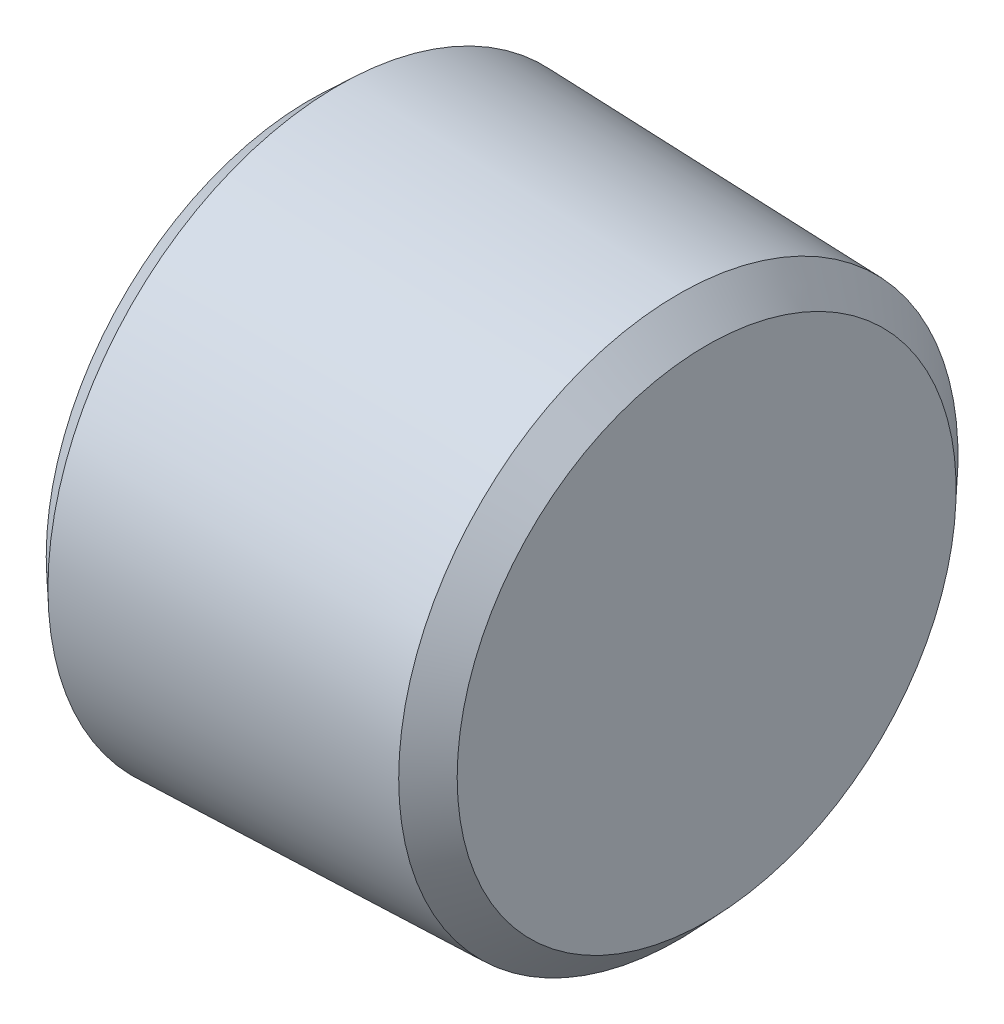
ISO-10303-21;
HEADER;
FILE_DESCRIPTION(('STEP AP214'),'2;1');
FILE_NAME('part.step','',(''),(''),'','','');
FILE_SCHEMA(('AUTOMOTIVE_DESIGN { 1 0 10303 214 1 1 1 1 }'));
ENDSEC;
DATA;
#1=APPLICATION_CONTEXT('core data for automotive mechanical design processes');
#2=APPLICATION_PROTOCOL_DEFINITION('international standard','automotive_design',2000,#1);
#3=PRODUCT_CONTEXT('',#1,'mechanical');
#4=PRODUCT('Part','Part','',(#3));
#5=PRODUCT_RELATED_PRODUCT_CATEGORY('part','',(#4));
#6=PRODUCT_DEFINITION_FORMATION('','',#4);
#7=PRODUCT_DEFINITION_CONTEXT('part definition',#1,'design');
#8=PRODUCT_DEFINITION('design','',#6,#7);
#9=PRODUCT_DEFINITION_SHAPE('','',#8);
#10=(LENGTH_UNIT() NAMED_UNIT(*) SI_UNIT(.MILLI.,.METRE.));
#11=(NAMED_UNIT(*) PLANE_ANGLE_UNIT() SI_UNIT($,.RADIAN.));
#12=(NAMED_UNIT(*) SI_UNIT($,.STERADIAN.) SOLID_ANGLE_UNIT());
#13=UNCERTAINTY_MEASURE_WITH_UNIT(LENGTH_MEASURE(1.E-05),#10,'distance_accuracy_value','');
#14=(GEOMETRIC_REPRESENTATION_CONTEXT(3) GLOBAL_UNCERTAINTY_ASSIGNED_CONTEXT((#13)) GLOBAL_UNIT_ASSIGNED_CONTEXT((#10,
#11,#12)) REPRESENTATION_CONTEXT('',''));
#15=CARTESIAN_POINT('',(0.,0.,0.));
#16=DIRECTION('',(0.,0.,1.));
#17=DIRECTION('',(1.,0.,0.));
#18=AXIS2_PLACEMENT_3D('',#15,#16,#17);
#19=CARTESIAN_POINT('',(3.50000000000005,1.44337567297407,-2.49999999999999));
#20=DIRECTION('',(-1.,0.,0.));
#21=DIRECTION('',(0.,0.,1.));
#22=AXIS2_PLACEMENT_3D('',#19,#20,#21);
#23=PLANE('',#22);
#24=CARTESIAN_POINT('',(3.5,0.,0.));
#25=DIRECTION('',(-1.,0.,0.));
#26=DIRECTION('',(0.,0.,1.));
#27=AXIS2_PLACEMENT_3D('',#24,#25,#26);
#28=CIRCLE('',#27,2.5);
#29=CARTESIAN_POINT('',(3.49999999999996,0.,2.50000000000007));
#30=VERTEX_POINT('',#29);
#31=CARTESIAN_POINT('',(3.5,2.1650635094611,1.25000000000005));
#32=VERTEX_POINT('',#31);
#33=EDGE_CURVE('E41',#30,#32,#28,.T.);
#34=ORIENTED_EDGE('',*,*,#33,.F.);
#35=DIRECTION('',(0.,-1.,0.));
#36=VECTOR('',#35,1.);
#37=CARTESIAN_POINT('',(3.5,1.44337567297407,2.50000000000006));
#38=LINE('',#37,#36);
#39=CARTESIAN_POINT('',(3.5,1.44337567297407,2.50000000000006));
#40=VERTEX_POINT('',#39);
#41=EDGE_CURVE('E129',#40,#30,#38,.T.);
#42=ORIENTED_EDGE('',*,*,#41,.F.);
#43=DIRECTION('',(0.,-0.5,0.866025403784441));
#44=VECTOR('',#43,1.);
#45=CARTESIAN_POINT('',(3.50000000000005,2.88675134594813,0.));
#46=LINE('',#45,#44);
#47=EDGE_CURVE('E127',#32,#40,#46,.T.);
#48=ORIENTED_EDGE('',*,*,#47,.F.);
#49=EDGE_LOOP('',(#34,#42,#48));
#50=FACE_BOUND('',#49,.T.);
#51=ADVANCED_FACE('F30',(#50),#23,.T.);
#52=CARTESIAN_POINT('',(3.50000000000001,2.1650635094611,-1.25));
#53=VERTEX_POINT('',#52);
#54=EDGE_CURVE('E11',#32,#53,#28,.T.);
#55=ORIENTED_EDGE('',*,*,#54,.F.);
#56=CARTESIAN_POINT('',(3.50000000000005,2.88675134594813,0.));
#57=VERTEX_POINT('',#56);
#58=EDGE_CURVE('E123',#57,#32,#46,.T.);
#59=ORIENTED_EDGE('',*,*,#58,.F.);
#60=DIRECTION('',(0.,0.5,0.86602540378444));
#61=VECTOR('',#60,1.);
#62=CARTESIAN_POINT('',(3.50000000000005,1.44337567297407,-2.49999999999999));
#63=LINE('',#62,#61);
#64=EDGE_CURVE('E125',#53,#57,#63,.T.);
#65=ORIENTED_EDGE('',*,*,#64,.F.);
#66=EDGE_LOOP('',(#55,#59,#65));
#67=FACE_BOUND('',#66,.T.);
#68=ADVANCED_FACE('F121',(#67),#23,.T.);
#69=CARTESIAN_POINT('',(3.50000000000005,0.,-2.5));
#70=VERTEX_POINT('',#69);
#71=EDGE_CURVE('E39',#53,#70,#28,.T.);
#72=ORIENTED_EDGE('',*,*,#71,.F.);
#73=CARTESIAN_POINT('',(3.50000000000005,1.44337567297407,-2.49999999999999));
#74=VERTEX_POINT('',#73);
#75=EDGE_CURVE('E132',#74,#53,#63,.T.);
#76=ORIENTED_EDGE('',*,*,#75,.F.);
#77=DIRECTION('',(0.,1.,0.));
#78=VECTOR('',#77,1.);
#79=CARTESIAN_POINT('',(3.50000000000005,-1.44337567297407,-2.49999999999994));
#80=LINE('',#79,#78);
#81=EDGE_CURVE('E149',#70,#74,#80,.T.);
#82=ORIENTED_EDGE('',*,*,#81,.F.);
#83=EDGE_LOOP('',(#72,#76,#82));
#84=FACE_BOUND('',#83,.T.);
#85=ADVANCED_FACE('F198',(#84),#23,.T.);
#86=CARTESIAN_POINT('',(3.5,-2.1650635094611,-1.24999999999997));
#87=VERTEX_POINT('',#86);
#88=EDGE_CURVE('E176',#70,#87,#28,.T.);
#89=ORIENTED_EDGE('',*,*,#88,.F.);
#90=CARTESIAN_POINT('',(3.50000000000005,-1.44337567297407,-2.49999999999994));
#91=VERTEX_POINT('',#90);
#92=EDGE_CURVE('E150',#91,#70,#80,.T.);
#93=ORIENTED_EDGE('',*,*,#92,.F.);
#94=DIRECTION('',(0.,0.5,-0.866025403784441));
#95=VECTOR('',#94,1.);
#96=CARTESIAN_POINT('',(3.5,-2.88675134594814,1.04083408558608E-13));
#97=LINE('',#96,#95);
#98=EDGE_CURVE('E145',#87,#91,#97,.T.);
#99=ORIENTED_EDGE('',*,*,#98,.F.);
#100=EDGE_LOOP('',(#89,#93,#99));
#101=FACE_BOUND('',#100,.T.);
#102=ADVANCED_FACE('F207',(#101),#23,.T.);
#103=CARTESIAN_POINT('',(3.5,-2.1650635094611,1.25000000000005));
#104=VERTEX_POINT('',#103);
#105=EDGE_CURVE('E48',#87,#104,#28,.T.);
#106=ORIENTED_EDGE('',*,*,#105,.F.);
#107=CARTESIAN_POINT('',(3.5,-2.88675134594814,1.04083408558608E-13));
#108=VERTEX_POINT('',#107);
#109=EDGE_CURVE('E146',#108,#87,#97,.T.);
#110=ORIENTED_EDGE('',*,*,#109,.F.);
#111=DIRECTION('',(0.,-0.5,-0.86602540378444));
#112=VECTOR('',#111,1.);
#113=CARTESIAN_POINT('',(3.49999999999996,-1.44337567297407,2.50000000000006));
#114=LINE('',#113,#112);
#115=EDGE_CURVE('E141',#104,#108,#114,.T.);
#116=ORIENTED_EDGE('',*,*,#115,.F.);
#117=EDGE_LOOP('',(#106,#110,#116));
#118=FACE_BOUND('',#117,.T.);
#119=ADVANCED_FACE('F206',(#118),#23,.T.);
#120=CARTESIAN_POINT('',(0.,0.,0.));
#121=DIRECTION('',(1.,0.,0.));
#122=DIRECTION('',(0.,0.,-1.));
#123=AXIS2_PLACEMENT_3D('',#120,#121,#122);
#124=PLANE('',#123);
#125=CARTESIAN_POINT('',(0.,0.,0.));
#126=DIRECTION('',(-1.,0.,0.));
#127=DIRECTION('',(0.,0.,1.));
#128=AXIS2_PLACEMENT_3D('',#125,#126,#127);
#129=CIRCLE('',#128,4.65153175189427);
#130=CARTESIAN_POINT('',(0.,0.,4.65153175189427));
#131=VERTEX_POINT('',#130);
#132=EDGE_CURVE('E34',#131,#131,#129,.T.);
#133=ORIENTED_EDGE('',*,*,#132,.T.);
#134=EDGE_LOOP('',(#133));
#135=FACE_BOUND('',#134,.T.);
#136=DIRECTION('',(0.,0.5,0.86602540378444));
#137=VECTOR('',#136,1.);
#138=CARTESIAN_POINT('',(0.,1.44337567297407,-2.49999999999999));
#139=LINE('',#138,#137);
#140=CARTESIAN_POINT('',(0.,1.44337567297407,-2.49999999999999));
#141=VERTEX_POINT('',#140);
#142=CARTESIAN_POINT('',(0.,2.88675134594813,0.));
#143=VERTEX_POINT('',#142);
#144=EDGE_CURVE('E56',#141,#143,#139,.T.);
#145=ORIENTED_EDGE('',*,*,#144,.T.);
#146=DIRECTION('',(0.,-0.5,0.866025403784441));
#147=VECTOR('',#146,1.);
#148=CARTESIAN_POINT('',(0.,2.88675134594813,0.));
#149=LINE('',#148,#147);
#150=CARTESIAN_POINT('',(0.,1.44337567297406,2.5000000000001));
#151=VERTEX_POINT('',#150);
#152=EDGE_CURVE('E179',#143,#151,#149,.T.);
#153=ORIENTED_EDGE('',*,*,#152,.T.);
#154=DIRECTION('',(0.,-1.,0.));
#155=VECTOR('',#154,1.);
#156=CARTESIAN_POINT('',(0.,1.44337567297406,2.5000000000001));
#157=LINE('',#156,#155);
#158=CARTESIAN_POINT('',(0.,-1.44337567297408,2.50000000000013));
#159=VERTEX_POINT('',#158);
#160=EDGE_CURVE('E182',#151,#159,#157,.T.);
#161=ORIENTED_EDGE('',*,*,#160,.T.);
#162=DIRECTION('',(0.,-0.5,-0.86602540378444));
#163=VECTOR('',#162,1.);
#164=CARTESIAN_POINT('',(0.,-1.44337567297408,2.50000000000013));
#165=LINE('',#164,#163);
#166=CARTESIAN_POINT('',(0.,-2.88675134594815,1.04083408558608E-13));
#167=VERTEX_POINT('',#166);
#168=EDGE_CURVE('E185',#159,#167,#165,.T.);
#169=ORIENTED_EDGE('',*,*,#168,.T.);
#170=DIRECTION('',(0.,0.5,-0.866025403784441));
#171=VECTOR('',#170,1.);
#172=CARTESIAN_POINT('',(0.,-2.88675134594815,1.04083408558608E-13));
#173=LINE('',#172,#171);
#174=CARTESIAN_POINT('',(0.,-1.44337567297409,-2.49999999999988));
#175=VERTEX_POINT('',#174);
#176=EDGE_CURVE('E188',#167,#175,#173,.T.);
#177=ORIENTED_EDGE('',*,*,#176,.T.);
#178=DIRECTION('',(0.,1.,0.));
#179=VECTOR('',#178,1.);
#180=CARTESIAN_POINT('',(0.,-1.44337567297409,-2.49999999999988));
#181=LINE('',#180,#179);
#182=EDGE_CURVE('E190',#175,#141,#181,.T.);
#183=ORIENTED_EDGE('',*,*,#182,.T.);
#184=EDGE_LOOP('',(#145,#153,#161,#169,#177,#183));
#185=FACE_BOUND('',#184,.T.);
#186=ADVANCED_FACE('F32',(#135,#185),#124,.F.);
#187=CARTESIAN_POINT('',(0.499756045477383,0.,0.));
#188=DIRECTION('',(1.,0.,0.));
#189=DIRECTION('',(0.,0.,-1.));
#190=AXIS2_PLACEMENT_3D('',#187,#188,#189);
#191=CONICAL_SURFACE('',#190,5.121,0.754158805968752);
#192=ORIENTED_EDGE('',*,*,#132,.F.);
#193=EDGE_LOOP('',(#192));
#194=FACE_BOUND('',#193,.T.);
#195=CARTESIAN_POINT('',(0.499756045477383,0.,0.));
#196=DIRECTION('',(-1.,0.,0.));
#197=DIRECTION('',(0.,0.,1.));
#198=AXIS2_PLACEMENT_3D('',#195,#196,#197);
#199=CIRCLE('',#198,5.121);
#200=CARTESIAN_POINT('',(0.499756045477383,0.,5.121));
#201=VERTEX_POINT('',#200);
#202=EDGE_CURVE('E169',#201,#201,#199,.T.);
#203=ORIENTED_EDGE('',*,*,#202,.T.);
#204=EDGE_LOOP('',(#203));
#205=FACE_BOUND('',#204,.T.);
#206=ADVANCED_FACE('F223',(#194,#205),#191,.T.);
#207=CARTESIAN_POINT('',(6.50024395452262,0.,0.));
#208=DIRECTION('',(-1.,0.,0.));
#209=DIRECTION('',(0.,0.,1.));
#210=AXIS2_PLACEMENT_3D('',#207,#208,#209);
#211=CONICAL_SURFACE('',#210,4.93348761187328,0.0312393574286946);
#212=ORIENTED_EDGE('',*,*,#202,.F.);
#213=EDGE_LOOP('',(#212));
#214=FACE_BOUND('',#213,.T.);
#215=CARTESIAN_POINT('',(6.50024395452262,0.,0.));
#216=DIRECTION('',(-1.,0.,0.));
#217=DIRECTION('',(0.,0.,1.));
#218=AXIS2_PLACEMENT_3D('',#215,#216,#217);
#219=CIRCLE('',#218,4.93348761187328);
#220=CARTESIAN_POINT('',(6.50024395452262,0.,4.93348761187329));
#221=VERTEX_POINT('',#220);
#222=EDGE_CURVE('E167',#221,#221,#219,.T.);
#223=ORIENTED_EDGE('',*,*,#222,.T.);
#224=EDGE_LOOP('',(#223));
#225=FACE_BOUND('',#224,.T.);
#226=ADVANCED_FACE('F228',(#214,#225),#211,.T.);
#227=CARTESIAN_POINT('',(7.,0.,0.));
#228=DIRECTION('',(-1.,0.,0.));
#229=DIRECTION('',(0.,0.,1.));
#230=AXIS2_PLACEMENT_3D('',#227,#228,#229);
#231=CONICAL_SURFACE('',#230,4.40148974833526,0.81663752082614);
#232=ORIENTED_EDGE('',*,*,#222,.F.);
#233=EDGE_LOOP('',(#232));
#234=FACE_BOUND('',#233,.T.);
#235=CARTESIAN_POINT('',(7.,0.,0.));
#236=DIRECTION('',(-1.,0.,0.));
#237=DIRECTION('',(0.,0.,1.));
#238=AXIS2_PLACEMENT_3D('',#235,#236,#237);
#239=CIRCLE('',#238,4.40148974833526);
#240=CARTESIAN_POINT('',(7.,0.,4.40148974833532));
#241=VERTEX_POINT('',#240);
#242=EDGE_CURVE('E164',#241,#241,#239,.T.);
#243=ORIENTED_EDGE('',*,*,#242,.T.);
#244=EDGE_LOOP('',(#243));
#245=FACE_BOUND('',#244,.T.);
#246=ADVANCED_FACE('F258',(#234,#245),#231,.T.);
#247=CARTESIAN_POINT('',(7.00000000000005,4.40148974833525,0.));
#248=DIRECTION('',(-1.,0.,0.));
#249=DIRECTION('',(0.,0.,1.));
#250=AXIS2_PLACEMENT_3D('',#247,#248,#249);
#251=PLANE('',#250);
#252=ORIENTED_EDGE('',*,*,#242,.F.);
#253=EDGE_LOOP('',(#252));
#254=FACE_BOUND('',#253,.T.);
#255=ADVANCED_FACE('F255',(#254),#251,.F.);
#256=CARTESIAN_POINT('',(3.50000000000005,1.44337567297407,-2.49999999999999));
#257=DIRECTION('',(0.,-0.866025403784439,0.500000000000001));
#258=DIRECTION('',(0.,-0.5,-0.86602540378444));
#259=AXIS2_PLACEMENT_3D('',#256,#257,#258);
#260=PLANE('',#259);
#261=ORIENTED_EDGE('',*,*,#144,.F.);
#262=DIRECTION('',(-1.,0.,0.));
#263=VECTOR('',#262,1.);
#264=CARTESIAN_POINT('',(3.50000000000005,1.44337567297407,-2.49999999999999));
#265=LINE('',#264,#263);
#266=EDGE_CURVE('E153',#74,#141,#265,.T.);
#267=ORIENTED_EDGE('',*,*,#266,.F.);
#268=ORIENTED_EDGE('',*,*,#75,.T.);
#269=ORIENTED_EDGE('',*,*,#64,.T.);
#270=DIRECTION('',(-1.,0.,0.));
#271=VECTOR('',#270,1.);
#272=CARTESIAN_POINT('',(3.50000000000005,2.88675134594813,0.));
#273=LINE('',#272,#271);
#274=EDGE_CURVE('E135',#57,#143,#273,.T.);
#275=ORIENTED_EDGE('',*,*,#274,.T.);
#276=EDGE_LOOP('',(#261,#267,#268,#269,#275));
#277=FACE_BOUND('',#276,.T.);
#278=ADVANCED_FACE('F195',(#277),#260,.T.);
#279=CARTESIAN_POINT('',(3.50000000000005,2.88675134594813,0.));
#280=DIRECTION('',(0.,-0.866025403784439,-0.5));
#281=DIRECTION('',(0.,0.5,-0.866025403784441));
#282=AXIS2_PLACEMENT_3D('',#279,#280,#281);
#283=PLANE('',#282);
#284=ORIENTED_EDGE('',*,*,#152,.F.);
#285=ORIENTED_EDGE('',*,*,#274,.F.);
#286=ORIENTED_EDGE('',*,*,#58,.T.);
#287=ORIENTED_EDGE('',*,*,#47,.T.);
#288=DIRECTION('',(-1.,0.,0.));
#289=VECTOR('',#288,1.);
#290=CARTESIAN_POINT('',(3.5,1.44337567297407,2.50000000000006));
#291=LINE('',#290,#289);
#292=EDGE_CURVE('E161',#40,#151,#291,.T.);
#293=ORIENTED_EDGE('',*,*,#292,.T.);
#294=EDGE_LOOP('',(#284,#285,#286,#287,#293));
#295=FACE_BOUND('',#294,.T.);
#296=ADVANCED_FACE('F134',(#295),#283,.T.);
#297=CARTESIAN_POINT('',(3.5,1.44337567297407,2.50000000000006));
#298=DIRECTION('',(0.,0.,-1.));
#299=DIRECTION('',(-1.,0.,0.));
#300=AXIS2_PLACEMENT_3D('',#297,#298,#299);
#301=PLANE('',#300);
#302=ORIENTED_EDGE('',*,*,#160,.F.);
#303=ORIENTED_EDGE('',*,*,#292,.F.);
#304=ORIENTED_EDGE('',*,*,#41,.T.);
#305=CARTESIAN_POINT('',(3.49999999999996,-1.44337567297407,2.50000000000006));
#306=VERTEX_POINT('',#305);
#307=EDGE_CURVE('E136',#30,#306,#38,.T.);
#308=ORIENTED_EDGE('',*,*,#307,.T.);
#309=DIRECTION('',(-1.,0.,0.));
#310=VECTOR('',#309,1.);
#311=CARTESIAN_POINT('',(3.49999999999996,-1.44337567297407,2.50000000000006));
#312=LINE('',#311,#310);
#313=EDGE_CURVE('E159',#306,#159,#312,.T.);
#314=ORIENTED_EDGE('',*,*,#313,.T.);
#315=EDGE_LOOP('',(#302,#303,#304,#308,#314));
#316=FACE_BOUND('',#315,.T.);
#317=ADVANCED_FACE('F221',(#316),#301,.T.);
#318=CARTESIAN_POINT('',(3.49999999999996,-1.44337567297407,2.50000000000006));
#319=DIRECTION('',(0.,0.866025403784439,-0.500000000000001));
#320=DIRECTION('',(0.,0.5,0.86602540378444));
#321=AXIS2_PLACEMENT_3D('',#318,#319,#320);
#322=PLANE('',#321);
#323=ORIENTED_EDGE('',*,*,#168,.F.);
#324=ORIENTED_EDGE('',*,*,#313,.F.);
#325=EDGE_CURVE('E142',#306,#104,#114,.T.);
#326=ORIENTED_EDGE('',*,*,#325,.T.);
#327=ORIENTED_EDGE('',*,*,#115,.T.);
#328=DIRECTION('',(-1.,0.,0.));
#329=VECTOR('',#328,1.);
#330=CARTESIAN_POINT('',(3.5,-2.88675134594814,1.04083408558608E-13));
#331=LINE('',#330,#329);
#332=EDGE_CURVE('E157',#108,#167,#331,.T.);
#333=ORIENTED_EDGE('',*,*,#332,.T.);
#334=EDGE_LOOP('',(#323,#324,#326,#327,#333));
#335=FACE_BOUND('',#334,.T.);
#336=ADVANCED_FACE('F215',(#335),#322,.T.);
#337=CARTESIAN_POINT('',(3.5,-2.88675134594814,1.04083408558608E-13));
#338=DIRECTION('',(0.,0.866025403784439,0.5));
#339=DIRECTION('',(0.,-0.5,0.866025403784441));
#340=AXIS2_PLACEMENT_3D('',#337,#338,#339);
#341=PLANE('',#340);
#342=ORIENTED_EDGE('',*,*,#176,.F.);
#343=ORIENTED_EDGE('',*,*,#332,.F.);
#344=ORIENTED_EDGE('',*,*,#109,.T.);
#345=ORIENTED_EDGE('',*,*,#98,.T.);
#346=DIRECTION('',(-1.,0.,0.));
#347=VECTOR('',#346,1.);
#348=CARTESIAN_POINT('',(3.50000000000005,-1.44337567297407,-2.49999999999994));
#349=LINE('',#348,#347);
#350=EDGE_CURVE('E155',#91,#175,#349,.T.);
#351=ORIENTED_EDGE('',*,*,#350,.T.);
#352=EDGE_LOOP('',(#342,#343,#344,#345,#351));
#353=FACE_BOUND('',#352,.T.);
#354=ADVANCED_FACE('F212',(#353),#341,.T.);
#355=CARTESIAN_POINT('',(3.50000000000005,-1.44337567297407,-2.49999999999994));
#356=DIRECTION('',(0.,0.,1.));
#357=DIRECTION('',(0.,-1.,0.));
#358=AXIS2_PLACEMENT_3D('',#355,#356,#357);
#359=PLANE('',#358);
#360=ORIENTED_EDGE('',*,*,#182,.F.);
#361=ORIENTED_EDGE('',*,*,#350,.F.);
#362=ORIENTED_EDGE('',*,*,#92,.T.);
#363=ORIENTED_EDGE('',*,*,#81,.T.);
#364=ORIENTED_EDGE('',*,*,#266,.T.);
#365=EDGE_LOOP('',(#360,#361,#362,#363,#364));
#366=FACE_BOUND('',#365,.T.);
#367=ADVANCED_FACE('F237',(#366),#359,.T.);
#368=EDGE_CURVE('E113',#104,#30,#28,.T.);
#369=ORIENTED_EDGE('',*,*,#368,.F.);
#370=ORIENTED_EDGE('',*,*,#325,.F.);
#371=ORIENTED_EDGE('',*,*,#307,.F.);
#372=EDGE_LOOP('',(#369,#370,#371));
#373=FACE_BOUND('',#372,.T.);
#374=ADVANCED_FACE('F108',(#373),#23,.T.);
#375=CARTESIAN_POINT('',(3.5,0.,0.));
#376=DIRECTION('',(-1.,0.,0.));
#377=DIRECTION('',(0.,0.,1.));
#378=AXIS2_PLACEMENT_3D('',#375,#376,#377);
#379=CONICAL_SURFACE('',#378,2.5,1.04719755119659);
#380=CARTESIAN_POINT('',(4.94337567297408,0.,0.));
#381=VERTEX_POINT('',#380);
#382=VERTEX_LOOP('',#381);
#383=FACE_BOUND('',#382,.T.);
#384=ORIENTED_EDGE('',*,*,#33,.T.);
#385=ORIENTED_EDGE('',*,*,#54,.T.);
#386=ORIENTED_EDGE('',*,*,#71,.T.);
#387=ORIENTED_EDGE('',*,*,#88,.T.);
#388=ORIENTED_EDGE('',*,*,#105,.T.);
#389=ORIENTED_EDGE('',*,*,#368,.T.);
#390=EDGE_LOOP('',(#384,#385,#386,#387,#388,#389));
#391=FACE_BOUND('',#390,.T.);
#392=ADVANCED_FACE('F106',(#383,#391),#379,.F.);
#393=CLOSED_SHELL('',(#51,#68,#85,#102,#119,#186,#206,#226,#246,#255,#278,#296,#317,#336,#354,
#367,#374,#392));
#394=MANIFOLD_SOLID_BREP('B2',#393);
#395=ADVANCED_BREP_SHAPE_REPRESENTATION('',(#18,#394),#14);
#396=SHAPE_DEFINITION_REPRESENTATION(#9,#395);
ENDSEC;
END-ISO-10303-21;
